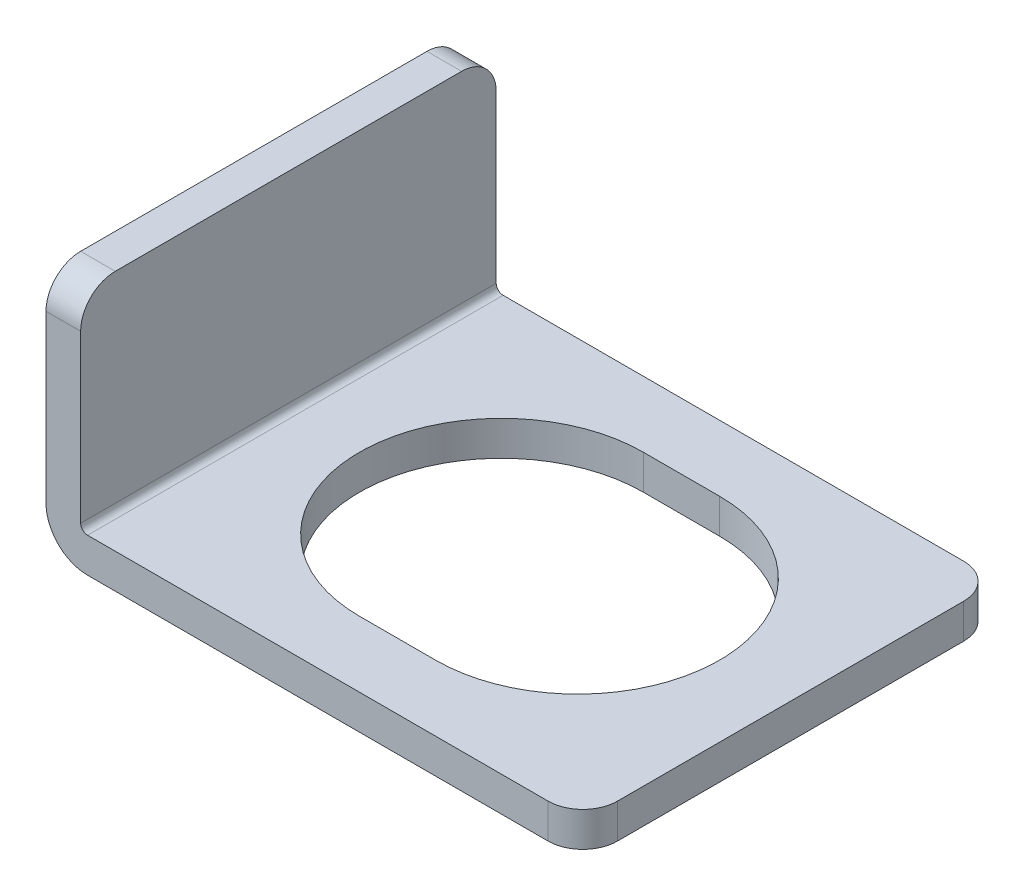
from build123d import *

# Parameters (mm, degrees)
BOSS_EXTRUDE1_DEPTH = 6
CUT_EXTRUDE1_DEPTH  = 18.670597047
FILLET1_R           = 1


with BuildPart() as part:
    # Sketch1 → Boss-Extrude1 (new, symmetric)
    with BuildSketch(Plane.XY):
        with BuildLine():
            Line((0, 1.2), (0, 7))
            Line((0, 7), (1, 7))
            Line((1, 7), (1, 1.2))
            ThreePointArc((1, 1.2), (1.058578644, 1.058578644), (1.2, 1))
            Line((1.2, 1), (15.5, 1))
            Line((15.5, 1), (15.5, 0))
            Line((15.5, 0), (1.2, 0))
            ThreePointArc((1.2, 0), (0.351471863, 0.351471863), (0, 1.2))
        make_face()
    extrude(amount=BOSS_EXTRUDE1_DEPTH, both=True)

    # Sketch2 → Cut-Extrude1 (cut, through all)
    with BuildSketch(Plane(origin=(0, 1, 0), x_dir=(1, 0, 0), z_dir=(0, 1, 0))):
        with BuildLine():
            Line((7.15, 4.1), (9.35, 4.1))
            ThreePointArc((9.35, 4.1), (13.45, 0), (9.35, -4.1))
            Line((9.35, -4.1), (7.15, -4.1))
            ThreePointArc((7.15, -4.1), (3.05, 0), (7.15, 4.1))
        make_face()
    extrude(amount=-CUT_EXTRUDE1_DEPTH, mode=Mode.SUBTRACT)

    # Fillet1
    fillet1_edges = [part.edges().sort_by_distance(p)[0] for p in [
        (0.5, 7, -6),
        (15.5, 0.5, 6),
        (0.5, 7, 6),
        (15.5, 0.5, -6),
    ]]
    fillet(fillet1_edges, radius=FILLET1_R)


solid = part.part
